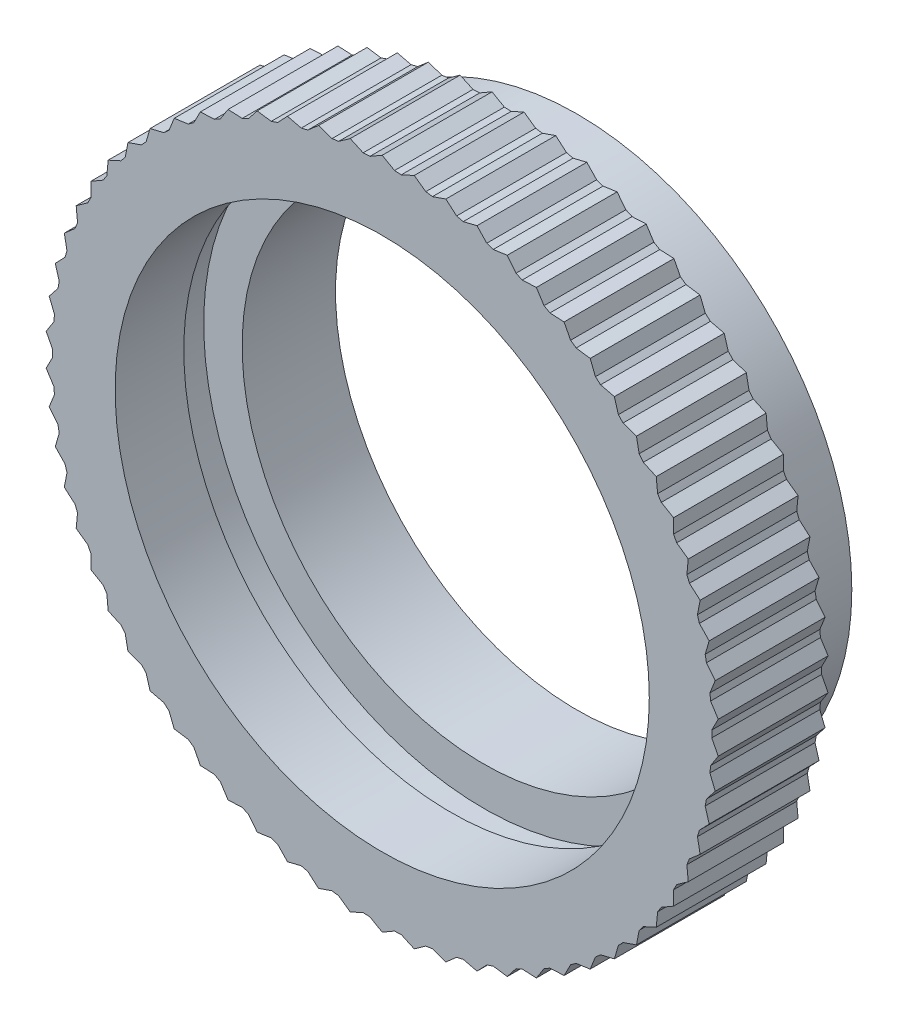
from build123d import *

# Parameters (mm, degrees)
BOSS_EXTRUDE1_START = -5.08
BOSS_EXTRUDE1_DEPTH = 5.08
CIRPATTERN1_COUNT   = 11


with BuildPart() as part:
    # Sketch2 → Revolve1 (revolve)
    with BuildSketch(Plane(origin=(0, 0, 0), x_dir=(0, 0, -1), z_dir=(1, 0, 0)), mode=Mode.PRIVATE) as revolve1_sk:
        Polygon((0, 15.24), (5.08, 15.24), (5.08, 12.065), (6.477, 12.065), (6.477, 12.7), (9.017, 12.7), (9.017, 11.176), (4.699, 11.176), (4.699, 12.954), (3.175, 12.954), (3.175, 12.35075), (0, 12.35075), align=None)
    revolve(revolve1_sk.sketch.rotate(Axis((0, 0, 11.596618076), (0, 0, -1)), 90), axis=Axis((0, 0, 11.596618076), (0, 0, -1)))

    # Sketch3 → Boss-Extrude1 (add)
    with BuildSketch(Plane.XY.offset(BOSS_EXTRUDE1_START)):
        with BuildLine():
            ThreePointArc((-0.56828424, 15.229400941), (0, 15.24), (0.56828424, 15.229400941))
            Line((0.56828424, 15.229400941), (0, 15.5575))
            Line((0, 15.5575), (-0.56828424, 15.229400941))
        make_face()
        with BuildLine():
            Line((13.473190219, 7.122551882), (13.473190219, 7.77875))
            Line((13.473190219, 7.77875), (12.904905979, 8.106849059))
            ThreePointArc((12.904905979, 8.106849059), (13.198227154, 7.62), (13.473190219, 7.122551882))
        make_face()
        with BuildLine():
            Line((13.473190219, -7.77875), (13.473190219, -7.122551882))
            ThreePointArc((13.473190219, -7.122551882), (13.198227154, -7.62), (12.904905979, -8.106849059))
            Line((12.904905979, -8.106849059), (13.473190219, -7.77875))
        make_face()
        with BuildLine():
            Line((0, -15.5575), (0.56828424, -15.229400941))
            ThreePointArc((0.56828424, -15.229400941), (0, -15.24), (-0.56828424, -15.229400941))
            Line((-0.56828424, -15.229400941), (0, -15.5575))
        make_face()
        with BuildLine():
            ThreePointArc((-12.904905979, -8.106849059), (-13.198227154, -7.62), (-13.473190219, -7.122551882))
            Line((-13.473190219, -7.122551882), (-13.473190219, -7.77875))
            Line((-13.473190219, -7.77875), (-12.904905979, -8.106849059))
        make_face()
        with BuildLine():
            ThreePointArc((-13.473190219, 7.122551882), (-13.198227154, 7.62), (-12.904905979, 8.106849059))
            Line((-12.904905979, 8.106849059), (-13.473190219, 7.77875))
            Line((-13.473190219, 7.77875), (-13.473190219, 7.122551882))
        make_face()
    boss_extrude1 = extrude(amount=BOSS_EXTRUDE1_DEPTH)

    # CirPattern1: Boss-Extrude1 ×11 about axis
    cirpattern1_axis = Axis((0, 0, 0), (0, 0, 1))
    for i in range(1, CIRPATTERN1_COUNT):
        add(boss_extrude1.rotate(cirpattern1_axis, i * 360 / CIRPATTERN1_COUNT))


solid = part.part
